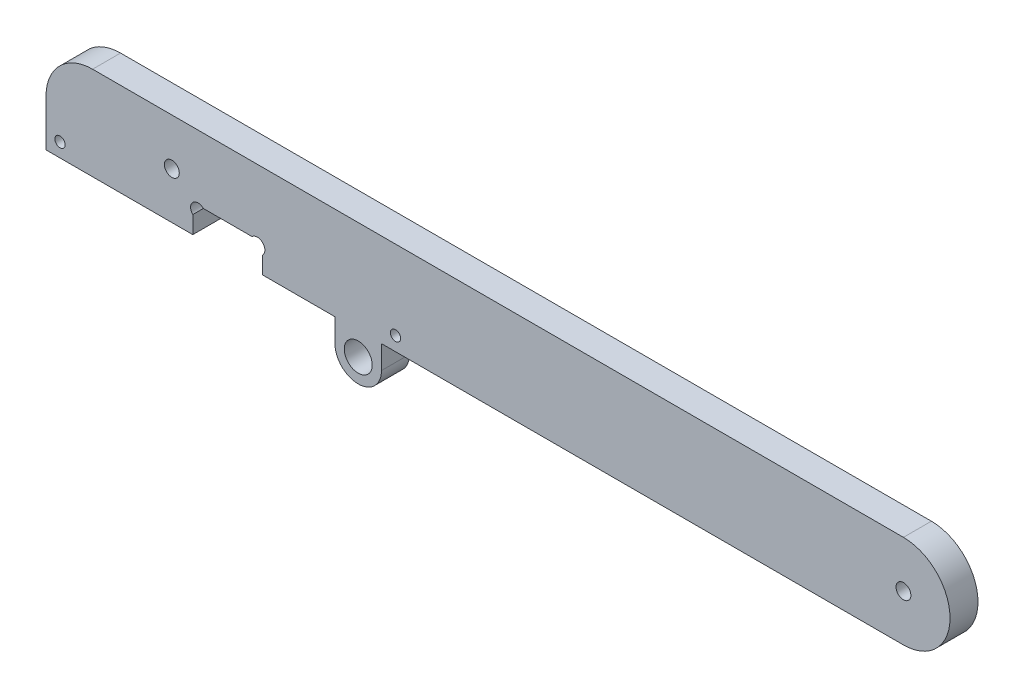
ISO-10303-21;
HEADER;
FILE_DESCRIPTION(('STEP AP214'),'2;1');
FILE_NAME('part.step','',(''),(''),'','','');
FILE_SCHEMA(('AUTOMOTIVE_DESIGN { 1 0 10303 214 1 1 1 1 }'));
ENDSEC;
DATA;
#1=APPLICATION_CONTEXT('core data for automotive mechanical design processes');
#2=APPLICATION_PROTOCOL_DEFINITION('international standard','automotive_design',2000,#1);
#3=PRODUCT_CONTEXT('',#1,'mechanical');
#4=PRODUCT('Part','Part','',(#3));
#5=PRODUCT_RELATED_PRODUCT_CATEGORY('part','',(#4));
#6=PRODUCT_DEFINITION_FORMATION('','',#4);
#7=PRODUCT_DEFINITION_CONTEXT('part definition',#1,'design');
#8=PRODUCT_DEFINITION('design','',#6,#7);
#9=PRODUCT_DEFINITION_SHAPE('','',#8);
#10=(LENGTH_UNIT() NAMED_UNIT(*) SI_UNIT(.MILLI.,.METRE.));
#11=(NAMED_UNIT(*) PLANE_ANGLE_UNIT() SI_UNIT($,.RADIAN.));
#12=(NAMED_UNIT(*) SI_UNIT($,.STERADIAN.) SOLID_ANGLE_UNIT());
#13=UNCERTAINTY_MEASURE_WITH_UNIT(LENGTH_MEASURE(1.E-05),#10,'distance_accuracy_value','');
#14=(GEOMETRIC_REPRESENTATION_CONTEXT(3) GLOBAL_UNCERTAINTY_ASSIGNED_CONTEXT((#13)) GLOBAL_UNIT_ASSIGNED_CONTEXT((#10,
#11,#12)) REPRESENTATION_CONTEXT('',''));
#15=CARTESIAN_POINT('',(0.,0.,0.));
#16=DIRECTION('',(0.,0.,1.));
#17=DIRECTION('',(1.,0.,0.));
#18=AXIS2_PLACEMENT_3D('',#15,#16,#17);
#19=CARTESIAN_POINT('',(184.,0.,6.));
#20=DIRECTION('',(0.,0.,1.));
#21=DIRECTION('',(1.,0.,0.));
#22=AXIS2_PLACEMENT_3D('',#19,#20,#21);
#23=PLANE('',#22);
#24=CARTESIAN_POINT('',(3.,-7.00000000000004,6.));
#25=DIRECTION('',(0.,0.,1.));
#26=DIRECTION('',(1.,0.,0.));
#27=AXIS2_PLACEMENT_3D('',#24,#25,#26);
#28=CIRCLE('',#27,1.1);
#29=CARTESIAN_POINT('',(4.1,-7.00000000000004,6.));
#30=VERTEX_POINT('',#29);
#31=EDGE_CURVE('E339',#30,#30,#28,.T.);
#32=ORIENTED_EDGE('',*,*,#31,.F.);
#33=EDGE_LOOP('',(#32));
#34=FACE_BOUND('',#33,.T.);
#35=CARTESIAN_POINT('',(184.,0.,6.));
#36=DIRECTION('',(0.,0.,1.));
#37=DIRECTION('',(1.,0.,0.));
#38=AXIS2_PLACEMENT_3D('',#35,#36,#37);
#39=CIRCLE('',#38,1.60000000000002);
#40=CARTESIAN_POINT('',(185.6,0.,6.));
#41=VERTEX_POINT('',#40);
#42=EDGE_CURVE('E351',#41,#41,#39,.T.);
#43=ORIENTED_EDGE('',*,*,#42,.F.);
#44=EDGE_LOOP('',(#43));
#45=FACE_BOUND('',#44,.T.);
#46=CARTESIAN_POINT('',(184.,0.,6.));
#47=DIRECTION('',(0.,0.,1.));
#48=DIRECTION('',(1.,0.,0.));
#49=AXIS2_PLACEMENT_3D('',#46,#47,#48);
#50=CIRCLE('',#49,10.);
#51=CARTESIAN_POINT('',(184.,-10.,6.));
#52=VERTEX_POINT('',#51);
#53=CARTESIAN_POINT('',(184.,9.99999999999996,6.));
#54=VERTEX_POINT('',#53);
#55=EDGE_CURVE('E205',#52,#54,#50,.T.);
#56=ORIENTED_EDGE('',*,*,#55,.T.);
#57=DIRECTION('',(-1.,0.,0.));
#58=VECTOR('',#57,1.);
#59=CARTESIAN_POINT('',(10.0000000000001,9.99999999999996,6.));
#60=LINE('',#59,#58);
#61=CARTESIAN_POINT('',(10.0000000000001,9.99999999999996,6.));
#62=VERTEX_POINT('',#61);
#63=EDGE_CURVE('E118',#54,#62,#60,.T.);
#64=ORIENTED_EDGE('',*,*,#63,.T.);
#65=CARTESIAN_POINT('',(10.,0.,6.));
#66=DIRECTION('',(0.,0.,1.));
#67=DIRECTION('',(-1.,0.,0.));
#68=AXIS2_PLACEMENT_3D('',#65,#66,#67);
#69=CIRCLE('',#68,10.);
#70=CARTESIAN_POINT('',(0.,-1.1442236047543E-13,6.));
#71=VERTEX_POINT('',#70);
#72=EDGE_CURVE('E241',#62,#71,#69,.T.);
#73=ORIENTED_EDGE('',*,*,#72,.T.);
#74=DIRECTION('',(0.,-1.,0.));
#75=VECTOR('',#74,1.);
#76=CARTESIAN_POINT('',(0.,-1.14491749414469E-13,6.));
#77=LINE('',#76,#75);
#78=CARTESIAN_POINT('',(0.,-9.99999999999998,6.));
#79=VERTEX_POINT('',#78);
#80=EDGE_CURVE('E260',#71,#79,#77,.T.);
#81=ORIENTED_EDGE('',*,*,#80,.T.);
#82=DIRECTION('',(1.,0.,0.));
#83=VECTOR('',#82,1.);
#84=CARTESIAN_POINT('',(0.,-9.99999999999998,6.));
#85=LINE('',#84,#83);
#86=CARTESIAN_POINT('',(31.5,-10.,6.));
#87=VERTEX_POINT('',#86);
#88=EDGE_CURVE('E257',#79,#87,#85,.T.);
#89=ORIENTED_EDGE('',*,*,#88,.T.);
#90=DIRECTION('',(0.,1.,0.));
#91=VECTOR('',#90,1.);
#92=CARTESIAN_POINT('',(31.5,-6.26274169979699,6.));
#93=LINE('',#92,#91);
#94=CARTESIAN_POINT('',(31.5,-6.26274169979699,6.));
#95=VERTEX_POINT('',#94);
#96=EDGE_CURVE('E259',#87,#95,#93,.T.);
#97=ORIENTED_EDGE('',*,*,#96,.T.);
#98=CARTESIAN_POINT('',(32.6313708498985,-5.13137084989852,6.));
#99=DIRECTION('',(0.,0.,-1.));
#100=DIRECTION('',(-1.,0.,0.));
#101=AXIS2_PLACEMENT_3D('',#98,#99,#100);
#102=CIRCLE('',#101,1.59999999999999);
#103=CARTESIAN_POINT('',(33.7627416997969,-4.00000000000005,6.));
#104=VERTEX_POINT('',#103);
#105=EDGE_CURVE('E262',#95,#104,#102,.T.);
#106=ORIENTED_EDGE('',*,*,#105,.T.);
#107=DIRECTION('',(1.,0.,0.));
#108=VECTOR('',#107,1.);
#109=CARTESIAN_POINT('',(33.7627416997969,-4.00000000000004,6.));
#110=LINE('',#109,#108);
#111=CARTESIAN_POINT('',(44.2372583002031,-4.00000000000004,6.));
#112=VERTEX_POINT('',#111);
#113=EDGE_CURVE('E268',#104,#112,#110,.T.);
#114=ORIENTED_EDGE('',*,*,#113,.T.);
#115=CARTESIAN_POINT('',(45.3686291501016,-5.13137084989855,6.));
#116=DIRECTION('',(0.,0.,-1.));
#117=DIRECTION('',(1.,0.,0.));
#118=AXIS2_PLACEMENT_3D('',#115,#116,#117);
#119=CIRCLE('',#118,1.59999999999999);
#120=CARTESIAN_POINT('',(46.5,-6.26274169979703,6.));
#121=VERTEX_POINT('',#120);
#122=EDGE_CURVE('E270',#112,#121,#119,.T.);
#123=ORIENTED_EDGE('',*,*,#122,.T.);
#124=DIRECTION('',(0.,-1.,0.));
#125=VECTOR('',#124,1.);
#126=CARTESIAN_POINT('',(46.5,-6.262741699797,6.));
#127=LINE('',#126,#125);
#128=CARTESIAN_POINT('',(46.5,-10.,6.));
#129=VERTEX_POINT('',#128);
#130=EDGE_CURVE('E272',#121,#129,#127,.T.);
#131=ORIENTED_EDGE('',*,*,#130,.T.);
#132=DIRECTION('',(1.,0.,0.));
#133=VECTOR('',#132,1.);
#134=CARTESIAN_POINT('',(46.5,-10.,6.));
#135=LINE('',#134,#133);
#136=CARTESIAN_POINT('',(62.,-10.,6.));
#137=VERTEX_POINT('',#136);
#138=EDGE_CURVE('E274',#129,#137,#135,.T.);
#139=ORIENTED_EDGE('',*,*,#138,.T.);
#140=DIRECTION('',(0.,-1.,0.));
#141=VECTOR('',#140,1.);
#142=CARTESIAN_POINT('',(62.,-15.,6.));
#143=LINE('',#142,#141);
#144=CARTESIAN_POINT('',(62.,-15.,6.));
#145=VERTEX_POINT('',#144);
#146=EDGE_CURVE('E158',#137,#145,#143,.T.);
#147=ORIENTED_EDGE('',*,*,#146,.T.);
#148=CARTESIAN_POINT('',(67.,-15.,6.));
#149=DIRECTION('',(0.,0.,1.));
#150=DIRECTION('',(1.,0.,0.));
#151=AXIS2_PLACEMENT_3D('',#148,#149,#150);
#152=CIRCLE('',#151,5.);
#153=CARTESIAN_POINT('',(72.,-15.,6.));
#154=VERTEX_POINT('',#153);
#155=EDGE_CURVE('E152',#145,#154,#152,.T.);
#156=ORIENTED_EDGE('',*,*,#155,.T.);
#157=DIRECTION('',(0.,1.,0.));
#158=VECTOR('',#157,1.);
#159=CARTESIAN_POINT('',(72.,-15.,6.));
#160=LINE('',#159,#158);
#161=CARTESIAN_POINT('',(72.,-10.,6.));
#162=VERTEX_POINT('',#161);
#163=EDGE_CURVE('E156',#154,#162,#160,.T.);
#164=ORIENTED_EDGE('',*,*,#163,.T.);
#165=DIRECTION('',(1.,0.,0.));
#166=VECTOR('',#165,1.);
#167=CARTESIAN_POINT('',(72.,-10.,6.));
#168=LINE('',#167,#166);
#169=EDGE_CURVE('E54',#162,#52,#168,.T.);
#170=ORIENTED_EDGE('',*,*,#169,.T.);
#171=EDGE_LOOP('',(#56,#64,#73,#81,#89,#97,#106,#114,#123,#131,#139,#147,#156,#164,#170));
#172=FACE_BOUND('',#171,.T.);
#173=CARTESIAN_POINT('',(27.,0.,6.));
#174=DIRECTION('',(0.,0.,1.));
#175=DIRECTION('',(1.,0.,0.));
#176=AXIS2_PLACEMENT_3D('',#173,#174,#175);
#177=CIRCLE('',#176,1.6);
#178=CARTESIAN_POINT('',(28.6,0.,6.));
#179=VERTEX_POINT('',#178);
#180=EDGE_CURVE('E180',#179,#179,#177,.T.);
#181=ORIENTED_EDGE('',*,*,#180,.F.);
#182=EDGE_LOOP('',(#181));
#183=FACE_BOUND('',#182,.T.);
#184=CARTESIAN_POINT('',(67.,-15.,6.));
#185=DIRECTION('',(0.,0.,1.));
#186=DIRECTION('',(1.,0.,0.));
#187=AXIS2_PLACEMENT_3D('',#184,#185,#186);
#188=CIRCLE('',#187,3.00000000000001);
#189=CARTESIAN_POINT('',(70.,-15.,6.));
#190=VERTEX_POINT('',#189);
#191=EDGE_CURVE('E345',#190,#190,#188,.T.);
#192=ORIENTED_EDGE('',*,*,#191,.F.);
#193=EDGE_LOOP('',(#192));
#194=FACE_BOUND('',#193,.T.);
#195=CARTESIAN_POINT('',(75.,-7.00000000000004,6.));
#196=DIRECTION('',(0.,0.,1.));
#197=DIRECTION('',(1.,0.,0.));
#198=AXIS2_PLACEMENT_3D('',#195,#196,#197);
#199=CIRCLE('',#198,1.10000000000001);
#200=CARTESIAN_POINT('',(76.1,-7.00000000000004,6.));
#201=VERTEX_POINT('',#200);
#202=EDGE_CURVE('E330',#201,#201,#199,.T.);
#203=ORIENTED_EDGE('',*,*,#202,.F.);
#204=EDGE_LOOP('',(#203));
#205=FACE_BOUND('',#204,.T.);
#206=ADVANCED_FACE('F37',(#34,#45,#172,#183,#194,#205),#23,.T.);
#207=CARTESIAN_POINT('',(184.,0.,0.));
#208=DIRECTION('',(0.,0.,1.));
#209=DIRECTION('',(1.,0.,0.));
#210=AXIS2_PLACEMENT_3D('',#207,#208,#209);
#211=PLANE('',#210);
#212=CARTESIAN_POINT('',(3.,-7.00000000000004,0.));
#213=DIRECTION('',(0.,0.,1.));
#214=DIRECTION('',(1.,0.,0.));
#215=AXIS2_PLACEMENT_3D('',#212,#213,#214);
#216=CIRCLE('',#215,1.1);
#217=CARTESIAN_POINT('',(4.1,-7.00000000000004,0.));
#218=VERTEX_POINT('',#217);
#219=EDGE_CURVE('E336',#218,#218,#216,.T.);
#220=ORIENTED_EDGE('',*,*,#219,.T.);
#221=EDGE_LOOP('',(#220));
#222=FACE_BOUND('',#221,.T.);
#223=CARTESIAN_POINT('',(184.,0.,0.));
#224=DIRECTION('',(0.,0.,1.));
#225=DIRECTION('',(1.,0.,0.));
#226=AXIS2_PLACEMENT_3D('',#223,#224,#225);
#227=CIRCLE('',#226,1.60000000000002);
#228=CARTESIAN_POINT('',(185.6,0.,0.));
#229=VERTEX_POINT('',#228);
#230=EDGE_CURVE('E348',#229,#229,#227,.T.);
#231=ORIENTED_EDGE('',*,*,#230,.T.);
#232=EDGE_LOOP('',(#231));
#233=FACE_BOUND('',#232,.T.);
#234=CARTESIAN_POINT('',(184.,0.,0.));
#235=DIRECTION('',(0.,0.,1.));
#236=DIRECTION('',(1.,0.,0.));
#237=AXIS2_PLACEMENT_3D('',#234,#235,#236);
#238=CIRCLE('',#237,10.);
#239=CARTESIAN_POINT('',(184.,-10.,0.));
#240=VERTEX_POINT('',#239);
#241=CARTESIAN_POINT('',(184.,9.99999999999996,0.));
#242=VERTEX_POINT('',#241);
#243=EDGE_CURVE('E176',#240,#242,#238,.T.);
#244=ORIENTED_EDGE('',*,*,#243,.F.);
#245=DIRECTION('',(1.,0.,0.));
#246=VECTOR('',#245,1.);
#247=CARTESIAN_POINT('',(72.,-10.,0.));
#248=LINE('',#247,#246);
#249=CARTESIAN_POINT('',(72.,-10.,0.));
#250=VERTEX_POINT('',#249);
#251=EDGE_CURVE('E110',#250,#240,#248,.T.);
#252=ORIENTED_EDGE('',*,*,#251,.F.);
#253=DIRECTION('',(0.,1.,0.));
#254=VECTOR('',#253,1.);
#255=CARTESIAN_POINT('',(72.,-15.,0.));
#256=LINE('',#255,#254);
#257=CARTESIAN_POINT('',(72.,-15.,0.));
#258=VERTEX_POINT('',#257);
#259=EDGE_CURVE('E104',#258,#250,#256,.T.);
#260=ORIENTED_EDGE('',*,*,#259,.F.);
#261=CARTESIAN_POINT('',(67.,-15.,0.));
#262=DIRECTION('',(0.,0.,1.));
#263=DIRECTION('',(1.,0.,0.));
#264=AXIS2_PLACEMENT_3D('',#261,#262,#263);
#265=CIRCLE('',#264,5.);
#266=CARTESIAN_POINT('',(62.,-15.,0.));
#267=VERTEX_POINT('',#266);
#268=EDGE_CURVE('E166',#267,#258,#265,.T.);
#269=ORIENTED_EDGE('',*,*,#268,.F.);
#270=DIRECTION('',(0.,-1.,0.));
#271=VECTOR('',#270,1.);
#272=CARTESIAN_POINT('',(62.,-15.,0.));
#273=LINE('',#272,#271);
#274=CARTESIAN_POINT('',(62.,-10.,0.));
#275=VERTEX_POINT('',#274);
#276=EDGE_CURVE('E200',#275,#267,#273,.T.);
#277=ORIENTED_EDGE('',*,*,#276,.F.);
#278=DIRECTION('',(1.,0.,0.));
#279=VECTOR('',#278,1.);
#280=CARTESIAN_POINT('',(46.5,-10.,0.));
#281=LINE('',#280,#279);
#282=CARTESIAN_POINT('',(46.5,-10.,0.));
#283=VERTEX_POINT('',#282);
#284=EDGE_CURVE('E198',#283,#275,#281,.T.);
#285=ORIENTED_EDGE('',*,*,#284,.F.);
#286=DIRECTION('',(0.,-1.,0.));
#287=VECTOR('',#286,1.);
#288=CARTESIAN_POINT('',(46.5,-6.262741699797,0.));
#289=LINE('',#288,#287);
#290=CARTESIAN_POINT('',(46.5,-6.26274169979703,0.));
#291=VERTEX_POINT('',#290);
#292=EDGE_CURVE('E196',#291,#283,#289,.T.);
#293=ORIENTED_EDGE('',*,*,#292,.F.);
#294=CARTESIAN_POINT('',(45.3686291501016,-5.13137084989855,0.));
#295=DIRECTION('',(0.,0.,-1.));
#296=DIRECTION('',(1.,0.,0.));
#297=AXIS2_PLACEMENT_3D('',#294,#295,#296);
#298=CIRCLE('',#297,1.59999999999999);
#299=CARTESIAN_POINT('',(44.2372583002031,-4.00000000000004,0.));
#300=VERTEX_POINT('',#299);
#301=EDGE_CURVE('E194',#300,#291,#298,.T.);
#302=ORIENTED_EDGE('',*,*,#301,.F.);
#303=DIRECTION('',(1.,0.,0.));
#304=VECTOR('',#303,1.);
#305=CARTESIAN_POINT('',(33.7627416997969,-4.00000000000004,0.));
#306=LINE('',#305,#304);
#307=CARTESIAN_POINT('',(33.7627416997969,-4.00000000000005,0.));
#308=VERTEX_POINT('',#307);
#309=EDGE_CURVE('E192',#308,#300,#306,.T.);
#310=ORIENTED_EDGE('',*,*,#309,.F.);
#311=CARTESIAN_POINT('',(32.6313708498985,-5.13137084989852,0.));
#312=DIRECTION('',(0.,0.,-1.));
#313=DIRECTION('',(-1.,0.,0.));
#314=AXIS2_PLACEMENT_3D('',#311,#312,#313);
#315=CIRCLE('',#314,1.59999999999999);
#316=CARTESIAN_POINT('',(31.5,-6.26274169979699,0.));
#317=VERTEX_POINT('',#316);
#318=EDGE_CURVE('E190',#317,#308,#315,.T.);
#319=ORIENTED_EDGE('',*,*,#318,.F.);
#320=DIRECTION('',(0.,1.,0.));
#321=VECTOR('',#320,1.);
#322=CARTESIAN_POINT('',(31.5,-6.26274169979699,0.));
#323=LINE('',#322,#321);
#324=CARTESIAN_POINT('',(31.5,-10.,0.));
#325=VERTEX_POINT('',#324);
#326=EDGE_CURVE('E188',#325,#317,#323,.T.);
#327=ORIENTED_EDGE('',*,*,#326,.F.);
#328=DIRECTION('',(1.,0.,0.));
#329=VECTOR('',#328,1.);
#330=CARTESIAN_POINT('',(0.,-9.99999999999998,0.));
#331=LINE('',#330,#329);
#332=CARTESIAN_POINT('',(0.,-9.99999999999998,0.));
#333=VERTEX_POINT('',#332);
#334=EDGE_CURVE('E186',#333,#325,#331,.T.);
#335=ORIENTED_EDGE('',*,*,#334,.F.);
#336=DIRECTION('',(0.,-1.,0.));
#337=VECTOR('',#336,1.);
#338=CARTESIAN_POINT('',(0.,-1.14491749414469E-13,0.));
#339=LINE('',#338,#337);
#340=CARTESIAN_POINT('',(0.,-1.1442236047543E-13,0.));
#341=VERTEX_POINT('',#340);
#342=EDGE_CURVE('E184',#341,#333,#339,.T.);
#343=ORIENTED_EDGE('',*,*,#342,.F.);
#344=CARTESIAN_POINT('',(10.,0.,0.));
#345=DIRECTION('',(0.,0.,1.));
#346=DIRECTION('',(-1.,0.,0.));
#347=AXIS2_PLACEMENT_3D('',#344,#345,#346);
#348=CIRCLE('',#347,10.);
#349=CARTESIAN_POINT('',(10.0000000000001,9.99999999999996,0.));
#350=VERTEX_POINT('',#349);
#351=EDGE_CURVE('E182',#350,#341,#348,.T.);
#352=ORIENTED_EDGE('',*,*,#351,.F.);
#353=DIRECTION('',(-1.,0.,0.));
#354=VECTOR('',#353,1.);
#355=CARTESIAN_POINT('',(10.0000000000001,9.99999999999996,0.));
#356=LINE('',#355,#354);
#357=EDGE_CURVE('E179',#242,#350,#356,.T.);
#358=ORIENTED_EDGE('',*,*,#357,.F.);
#359=EDGE_LOOP('',(#244,#252,#260,#269,#277,#285,#293,#302,#310,#319,#327,#335,#343,#352,#358));
#360=FACE_BOUND('',#359,.T.);
#361=CARTESIAN_POINT('',(27.,0.,0.));
#362=DIRECTION('',(0.,0.,1.));
#363=DIRECTION('',(1.,0.,0.));
#364=AXIS2_PLACEMENT_3D('',#361,#362,#363);
#365=CIRCLE('',#364,1.6);
#366=CARTESIAN_POINT('',(28.6,0.,0.));
#367=VERTEX_POINT('',#366);
#368=EDGE_CURVE('E354',#367,#367,#365,.T.);
#369=ORIENTED_EDGE('',*,*,#368,.T.);
#370=EDGE_LOOP('',(#369));
#371=FACE_BOUND('',#370,.T.);
#372=CARTESIAN_POINT('',(67.,-15.,0.));
#373=DIRECTION('',(0.,0.,1.));
#374=DIRECTION('',(1.,0.,0.));
#375=AXIS2_PLACEMENT_3D('',#372,#373,#374);
#376=CIRCLE('',#375,3.00000000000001);
#377=CARTESIAN_POINT('',(70.,-15.,0.));
#378=VERTEX_POINT('',#377);
#379=EDGE_CURVE('E342',#378,#378,#376,.T.);
#380=ORIENTED_EDGE('',*,*,#379,.T.);
#381=EDGE_LOOP('',(#380));
#382=FACE_BOUND('',#381,.T.);
#383=CARTESIAN_POINT('',(75.,-7.00000000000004,0.));
#384=DIRECTION('',(0.,0.,1.));
#385=DIRECTION('',(1.,0.,0.));
#386=AXIS2_PLACEMENT_3D('',#383,#384,#385);
#387=CIRCLE('',#386,1.10000000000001);
#388=CARTESIAN_POINT('',(76.1,-7.00000000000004,0.));
#389=VERTEX_POINT('',#388);
#390=EDGE_CURVE('E333',#389,#389,#387,.T.);
#391=ORIENTED_EDGE('',*,*,#390,.T.);
#392=EDGE_LOOP('',(#391));
#393=FACE_BOUND('',#392,.T.);
#394=ADVANCED_FACE('F245',(#222,#233,#360,#371,#382,#393),#211,.F.);
#395=CARTESIAN_POINT('',(184.,0.,6.));
#396=DIRECTION('',(0.,0.,-1.));
#397=DIRECTION('',(-1.,0.,0.));
#398=AXIS2_PLACEMENT_3D('',#395,#396,#397);
#399=CYLINDRICAL_SURFACE('',#398,10.);
#400=ORIENTED_EDGE('',*,*,#243,.T.);
#401=DIRECTION('',(0.,0.,-1.));
#402=VECTOR('',#401,1.);
#403=CARTESIAN_POINT('',(184.,9.99999999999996,6.));
#404=LINE('',#403,#402);
#405=EDGE_CURVE('E11',#54,#242,#404,.T.);
#406=ORIENTED_EDGE('',*,*,#405,.F.);
#407=ORIENTED_EDGE('',*,*,#55,.F.);
#408=DIRECTION('',(0.,0.,-1.));
#409=VECTOR('',#408,1.);
#410=CARTESIAN_POINT('',(184.,-10.,6.));
#411=LINE('',#410,#409);
#412=EDGE_CURVE('E172',#52,#240,#411,.T.);
#413=ORIENTED_EDGE('',*,*,#412,.T.);
#414=EDGE_LOOP('',(#400,#406,#407,#413));
#415=FACE_BOUND('',#414,.T.);
#416=ADVANCED_FACE('F39',(#415),#399,.T.);
#417=CARTESIAN_POINT('',(10.0000000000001,9.99999999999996,6.));
#418=DIRECTION('',(0.,-1.,0.));
#419=DIRECTION('',(0.,0.,-1.));
#420=AXIS2_PLACEMENT_3D('',#417,#418,#419);
#421=PLANE('',#420);
#422=ORIENTED_EDGE('',*,*,#357,.T.);
#423=DIRECTION('',(0.,0.,-1.));
#424=VECTOR('',#423,1.);
#425=CARTESIAN_POINT('',(10.0000000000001,9.99999999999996,6.));
#426=LINE('',#425,#424);
#427=EDGE_CURVE('E46',#62,#350,#426,.T.);
#428=ORIENTED_EDGE('',*,*,#427,.F.);
#429=ORIENTED_EDGE('',*,*,#63,.F.);
#430=ORIENTED_EDGE('',*,*,#405,.T.);
#431=EDGE_LOOP('',(#422,#428,#429,#430));
#432=FACE_BOUND('',#431,.T.);
#433=ADVANCED_FACE('F502',(#432),#421,.F.);
#434=CARTESIAN_POINT('',(10.,0.,6.));
#435=DIRECTION('',(0.,0.,-1.));
#436=DIRECTION('',(-1.,0.,0.));
#437=AXIS2_PLACEMENT_3D('',#434,#435,#436);
#438=CYLINDRICAL_SURFACE('',#437,10.);
#439=ORIENTED_EDGE('',*,*,#351,.T.);
#440=DIRECTION('',(0.,0.,-1.));
#441=VECTOR('',#440,1.);
#442=CARTESIAN_POINT('',(0.,-1.1442236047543E-13,6.));
#443=LINE('',#442,#441);
#444=EDGE_CURVE('E233',#71,#341,#443,.T.);
#445=ORIENTED_EDGE('',*,*,#444,.F.);
#446=ORIENTED_EDGE('',*,*,#72,.F.);
#447=ORIENTED_EDGE('',*,*,#427,.T.);
#448=EDGE_LOOP('',(#439,#445,#446,#447));
#449=FACE_BOUND('',#448,.T.);
#450=ADVANCED_FACE('F239',(#449),#438,.T.);
#451=CARTESIAN_POINT('',(0.,-1.14491749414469E-13,6.));
#452=DIRECTION('',(1.,0.,0.));
#453=DIRECTION('',(0.,0.,-1.));
#454=AXIS2_PLACEMENT_3D('',#451,#452,#453);
#455=PLANE('',#454);
#456=ORIENTED_EDGE('',*,*,#342,.T.);
#457=DIRECTION('',(0.,0.,-1.));
#458=VECTOR('',#457,1.);
#459=CARTESIAN_POINT('',(0.,-9.99999999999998,6.));
#460=LINE('',#459,#458);
#461=EDGE_CURVE('E230',#79,#333,#460,.T.);
#462=ORIENTED_EDGE('',*,*,#461,.F.);
#463=ORIENTED_EDGE('',*,*,#80,.F.);
#464=ORIENTED_EDGE('',*,*,#444,.T.);
#465=EDGE_LOOP('',(#456,#462,#463,#464));
#466=FACE_BOUND('',#465,.T.);
#467=ADVANCED_FACE('F251',(#466),#455,.F.);
#468=CARTESIAN_POINT('',(0.,-9.99999999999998,6.));
#469=DIRECTION('',(0.,1.,0.));
#470=DIRECTION('',(-1.,0.,0.));
#471=AXIS2_PLACEMENT_3D('',#468,#469,#470);
#472=PLANE('',#471);
#473=ORIENTED_EDGE('',*,*,#334,.T.);
#474=DIRECTION('',(0.,0.,-1.));
#475=VECTOR('',#474,1.);
#476=CARTESIAN_POINT('',(31.5,-10.,6.));
#477=LINE('',#476,#475);
#478=EDGE_CURVE('E227',#87,#325,#477,.T.);
#479=ORIENTED_EDGE('',*,*,#478,.F.);
#480=ORIENTED_EDGE('',*,*,#88,.F.);
#481=ORIENTED_EDGE('',*,*,#461,.T.);
#482=EDGE_LOOP('',(#473,#479,#480,#481));
#483=FACE_BOUND('',#482,.T.);
#484=ADVANCED_FACE('F255',(#483),#472,.F.);
#485=CARTESIAN_POINT('',(31.5,-6.26274169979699,6.));
#486=DIRECTION('',(-1.,0.,0.));
#487=DIRECTION('',(0.,-1.,0.));
#488=AXIS2_PLACEMENT_3D('',#485,#486,#487);
#489=PLANE('',#488);
#490=ORIENTED_EDGE('',*,*,#326,.T.);
#491=DIRECTION('',(0.,0.,-1.));
#492=VECTOR('',#491,1.);
#493=CARTESIAN_POINT('',(31.5,-6.26274169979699,6.));
#494=LINE('',#493,#492);
#495=EDGE_CURVE('E224',#95,#317,#494,.T.);
#496=ORIENTED_EDGE('',*,*,#495,.F.);
#497=ORIENTED_EDGE('',*,*,#96,.F.);
#498=ORIENTED_EDGE('',*,*,#478,.T.);
#499=EDGE_LOOP('',(#490,#496,#497,#498));
#500=FACE_BOUND('',#499,.T.);
#501=ADVANCED_FACE('F467',(#500),#489,.F.);
#502=CARTESIAN_POINT('',(32.6313708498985,-5.13137084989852,6.));
#503=DIRECTION('',(0.,0.,-1.));
#504=DIRECTION('',(-1.,0.,0.));
#505=AXIS2_PLACEMENT_3D('',#502,#503,#504);
#506=CYLINDRICAL_SURFACE('',#505,1.59999999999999);
#507=ORIENTED_EDGE('',*,*,#318,.T.);
#508=DIRECTION('',(0.,0.,-1.));
#509=VECTOR('',#508,1.);
#510=CARTESIAN_POINT('',(33.7627416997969,-4.00000000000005,6.));
#511=LINE('',#510,#509);
#512=EDGE_CURVE('E221',#104,#308,#511,.T.);
#513=ORIENTED_EDGE('',*,*,#512,.F.);
#514=ORIENTED_EDGE('',*,*,#105,.F.);
#515=ORIENTED_EDGE('',*,*,#495,.T.);
#516=EDGE_LOOP('',(#507,#513,#514,#515));
#517=FACE_BOUND('',#516,.T.);
#518=ADVANCED_FACE('F457',(#517),#506,.F.);
#519=CARTESIAN_POINT('',(33.7627416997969,-4.00000000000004,6.));
#520=DIRECTION('',(0.,1.,0.));
#521=DIRECTION('',(-1.,0.,0.));
#522=AXIS2_PLACEMENT_3D('',#519,#520,#521);
#523=PLANE('',#522);
#524=ORIENTED_EDGE('',*,*,#309,.T.);
#525=DIRECTION('',(0.,0.,-1.));
#526=VECTOR('',#525,1.);
#527=CARTESIAN_POINT('',(44.2372583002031,-4.00000000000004,6.));
#528=LINE('',#527,#526);
#529=EDGE_CURVE('E218',#112,#300,#528,.T.);
#530=ORIENTED_EDGE('',*,*,#529,.F.);
#531=ORIENTED_EDGE('',*,*,#113,.F.);
#532=ORIENTED_EDGE('',*,*,#512,.T.);
#533=EDGE_LOOP('',(#524,#530,#531,#532));
#534=FACE_BOUND('',#533,.T.);
#535=ADVANCED_FACE('F447',(#534),#523,.F.);
#536=CARTESIAN_POINT('',(45.3686291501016,-5.13137084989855,6.));
#537=DIRECTION('',(0.,0.,-1.));
#538=DIRECTION('',(-1.,0.,0.));
#539=AXIS2_PLACEMENT_3D('',#536,#537,#538);
#540=CYLINDRICAL_SURFACE('',#539,1.59999999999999);
#541=ORIENTED_EDGE('',*,*,#301,.T.);
#542=DIRECTION('',(0.,0.,-1.));
#543=VECTOR('',#542,1.);
#544=CARTESIAN_POINT('',(46.5,-6.26274169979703,6.));
#545=LINE('',#544,#543);
#546=EDGE_CURVE('E215',#121,#291,#545,.T.);
#547=ORIENTED_EDGE('',*,*,#546,.F.);
#548=ORIENTED_EDGE('',*,*,#122,.F.);
#549=ORIENTED_EDGE('',*,*,#529,.T.);
#550=EDGE_LOOP('',(#541,#547,#548,#549));
#551=FACE_BOUND('',#550,.T.);
#552=ADVANCED_FACE('F437',(#551),#540,.F.);
#553=CARTESIAN_POINT('',(46.5,-6.262741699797,6.));
#554=DIRECTION('',(1.,0.,0.));
#555=DIRECTION('',(0.,1.,0.));
#556=AXIS2_PLACEMENT_3D('',#553,#554,#555);
#557=PLANE('',#556);
#558=ORIENTED_EDGE('',*,*,#292,.T.);
#559=DIRECTION('',(0.,0.,-1.));
#560=VECTOR('',#559,1.);
#561=CARTESIAN_POINT('',(46.5,-10.,6.));
#562=LINE('',#561,#560);
#563=EDGE_CURVE('E212',#129,#283,#562,.T.);
#564=ORIENTED_EDGE('',*,*,#563,.F.);
#565=ORIENTED_EDGE('',*,*,#130,.F.);
#566=ORIENTED_EDGE('',*,*,#546,.T.);
#567=EDGE_LOOP('',(#558,#564,#565,#566));
#568=FACE_BOUND('',#567,.T.);
#569=ADVANCED_FACE('F428',(#568),#557,.F.);
#570=CARTESIAN_POINT('',(46.5,-10.,6.));
#571=DIRECTION('',(0.,1.,0.));
#572=DIRECTION('',(-1.,0.,0.));
#573=AXIS2_PLACEMENT_3D('',#570,#571,#572);
#574=PLANE('',#573);
#575=ORIENTED_EDGE('',*,*,#284,.T.);
#576=DIRECTION('',(0.,0.,-1.));
#577=VECTOR('',#576,1.);
#578=CARTESIAN_POINT('',(62.,-10.,6.));
#579=LINE('',#578,#577);
#580=EDGE_CURVE('E209',#137,#275,#579,.T.);
#581=ORIENTED_EDGE('',*,*,#580,.F.);
#582=ORIENTED_EDGE('',*,*,#138,.F.);
#583=ORIENTED_EDGE('',*,*,#563,.T.);
#584=EDGE_LOOP('',(#575,#581,#582,#583));
#585=FACE_BOUND('',#584,.T.);
#586=ADVANCED_FACE('F280',(#585),#574,.F.);
#587=CARTESIAN_POINT('',(62.,-15.,6.));
#588=DIRECTION('',(1.,0.,0.));
#589=DIRECTION('',(0.,0.,-1.));
#590=AXIS2_PLACEMENT_3D('',#587,#588,#589);
#591=PLANE('',#590);
#592=ORIENTED_EDGE('',*,*,#276,.T.);
#593=DIRECTION('',(0.,0.,-1.));
#594=VECTOR('',#593,1.);
#595=CARTESIAN_POINT('',(62.,-15.,6.));
#596=LINE('',#595,#594);
#597=EDGE_CURVE('E167',#145,#267,#596,.T.);
#598=ORIENTED_EDGE('',*,*,#597,.F.);
#599=ORIENTED_EDGE('',*,*,#146,.F.);
#600=ORIENTED_EDGE('',*,*,#580,.T.);
#601=EDGE_LOOP('',(#592,#598,#599,#600));
#602=FACE_BOUND('',#601,.T.);
#603=ADVANCED_FACE('F284',(#602),#591,.F.);
#604=CARTESIAN_POINT('',(67.,-15.,6.));
#605=DIRECTION('',(0.,0.,-1.));
#606=DIRECTION('',(-1.,0.,0.));
#607=AXIS2_PLACEMENT_3D('',#604,#605,#606);
#608=CYLINDRICAL_SURFACE('',#607,5.);
#609=ORIENTED_EDGE('',*,*,#268,.T.);
#610=DIRECTION('',(0.,0.,-1.));
#611=VECTOR('',#610,1.);
#612=CARTESIAN_POINT('',(72.,-15.,6.));
#613=LINE('',#612,#611);
#614=EDGE_CURVE('E163',#154,#258,#613,.T.);
#615=ORIENTED_EDGE('',*,*,#614,.F.);
#616=ORIENTED_EDGE('',*,*,#155,.F.);
#617=ORIENTED_EDGE('',*,*,#597,.T.);
#618=EDGE_LOOP('',(#609,#615,#616,#617));
#619=FACE_BOUND('',#618,.T.);
#620=ADVANCED_FACE('F164',(#619),#608,.T.);
#621=CARTESIAN_POINT('',(72.,-15.,6.));
#622=DIRECTION('',(-1.,0.,0.));
#623=DIRECTION('',(0.,0.,1.));
#624=AXIS2_PLACEMENT_3D('',#621,#622,#623);
#625=PLANE('',#624);
#626=ORIENTED_EDGE('',*,*,#259,.T.);
#627=DIRECTION('',(0.,0.,-1.));
#628=VECTOR('',#627,1.);
#629=CARTESIAN_POINT('',(72.,-10.,6.));
#630=LINE('',#629,#628);
#631=EDGE_CURVE('E168',#162,#250,#630,.T.);
#632=ORIENTED_EDGE('',*,*,#631,.F.);
#633=ORIENTED_EDGE('',*,*,#163,.F.);
#634=ORIENTED_EDGE('',*,*,#614,.T.);
#635=EDGE_LOOP('',(#626,#632,#633,#634));
#636=FACE_BOUND('',#635,.T.);
#637=ADVANCED_FACE('F170',(#636),#625,.F.);
#638=CARTESIAN_POINT('',(72.,-10.,6.));
#639=DIRECTION('',(0.,1.,0.));
#640=DIRECTION('',(0.,0.,1.));
#641=AXIS2_PLACEMENT_3D('',#638,#639,#640);
#642=PLANE('',#641);
#643=ORIENTED_EDGE('',*,*,#251,.T.);
#644=ORIENTED_EDGE('',*,*,#412,.F.);
#645=ORIENTED_EDGE('',*,*,#169,.F.);
#646=ORIENTED_EDGE('',*,*,#631,.T.);
#647=EDGE_LOOP('',(#643,#644,#645,#646));
#648=FACE_BOUND('',#647,.T.);
#649=ADVANCED_FACE('F288',(#648),#642,.F.);
#650=CARTESIAN_POINT('',(27.,0.,6.));
#651=DIRECTION('',(0.,0.,-1.));
#652=DIRECTION('',(-1.,0.,0.));
#653=AXIS2_PLACEMENT_3D('',#650,#651,#652);
#654=CYLINDRICAL_SURFACE('',#653,1.6);
#655=ORIENTED_EDGE('',*,*,#180,.T.);
#656=EDGE_LOOP('',(#655));
#657=FACE_BOUND('',#656,.T.);
#658=ORIENTED_EDGE('',*,*,#368,.F.);
#659=EDGE_LOOP('',(#658));
#660=FACE_BOUND('',#659,.T.);
#661=ADVANCED_FACE('F290',(#657,#660),#654,.F.);
#662=CARTESIAN_POINT('',(184.,0.,6.));
#663=DIRECTION('',(0.,0.,-1.));
#664=DIRECTION('',(-1.,0.,0.));
#665=AXIS2_PLACEMENT_3D('',#662,#663,#664);
#666=CYLINDRICAL_SURFACE('',#665,1.60000000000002);
#667=ORIENTED_EDGE('',*,*,#42,.T.);
#668=EDGE_LOOP('',(#667));
#669=FACE_BOUND('',#668,.T.);
#670=ORIENTED_EDGE('',*,*,#230,.F.);
#671=EDGE_LOOP('',(#670));
#672=FACE_BOUND('',#671,.T.);
#673=ADVANCED_FACE('F296',(#669,#672),#666,.F.);
#674=CARTESIAN_POINT('',(67.,-15.,6.));
#675=DIRECTION('',(0.,0.,-1.));
#676=DIRECTION('',(-1.,0.,0.));
#677=AXIS2_PLACEMENT_3D('',#674,#675,#676);
#678=CYLINDRICAL_SURFACE('',#677,3.00000000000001);
#679=ORIENTED_EDGE('',*,*,#191,.T.);
#680=EDGE_LOOP('',(#679));
#681=FACE_BOUND('',#680,.T.);
#682=ORIENTED_EDGE('',*,*,#379,.F.);
#683=EDGE_LOOP('',(#682));
#684=FACE_BOUND('',#683,.T.);
#685=ADVANCED_FACE('F313',(#681,#684),#678,.F.);
#686=CARTESIAN_POINT('',(3.,-7.00000000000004,6.));
#687=DIRECTION('',(0.,0.,-1.));
#688=DIRECTION('',(-1.,0.,0.));
#689=AXIS2_PLACEMENT_3D('',#686,#687,#688);
#690=CYLINDRICAL_SURFACE('',#689,1.1);
#691=ORIENTED_EDGE('',*,*,#31,.T.);
#692=EDGE_LOOP('',(#691));
#693=FACE_BOUND('',#692,.T.);
#694=ORIENTED_EDGE('',*,*,#219,.F.);
#695=EDGE_LOOP('',(#694));
#696=FACE_BOUND('',#695,.T.);
#697=ADVANCED_FACE('F317',(#693,#696),#690,.F.);
#698=CARTESIAN_POINT('',(75.,-7.00000000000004,6.));
#699=DIRECTION('',(0.,0.,-1.));
#700=DIRECTION('',(-1.,0.,0.));
#701=AXIS2_PLACEMENT_3D('',#698,#699,#700);
#702=CYLINDRICAL_SURFACE('',#701,1.10000000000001);
#703=ORIENTED_EDGE('',*,*,#202,.T.);
#704=EDGE_LOOP('',(#703));
#705=FACE_BOUND('',#704,.T.);
#706=ORIENTED_EDGE('',*,*,#390,.F.);
#707=EDGE_LOOP('',(#706));
#708=FACE_BOUND('',#707,.T.);
#709=ADVANCED_FACE('F321',(#705,#708),#702,.F.);
#710=CLOSED_SHELL('',(#206,#394,#416,#433,#450,#467,#484,#501,#518,#535,#552,#569,#586,#603,
#620,#637,#649,#661,#673,#685,#697,#709));
#711=MANIFOLD_SOLID_BREP('B2',#710);
#712=ADVANCED_BREP_SHAPE_REPRESENTATION('',(#18,#711),#14);
#713=SHAPE_DEFINITION_REPRESENTATION(#9,#712);
ENDSEC;
END-ISO-10303-21;
